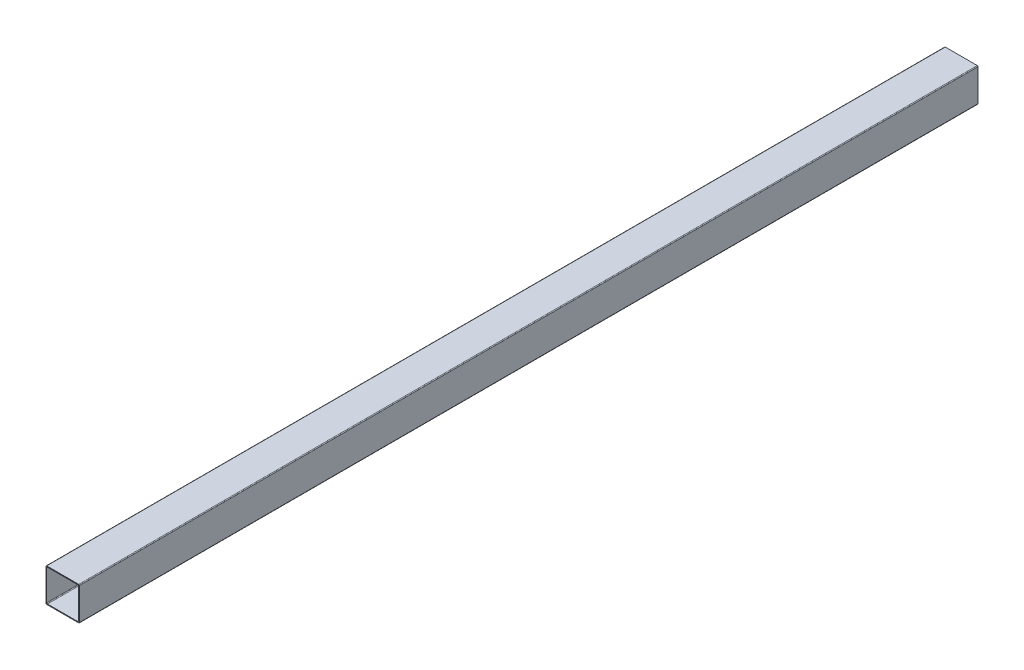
ISO-10303-21;
HEADER;
FILE_DESCRIPTION(('STEP AP214'),'2;1');
FILE_NAME('part.step','',(''),(''),'','','');
FILE_SCHEMA(('AUTOMOTIVE_DESIGN { 1 0 10303 214 1 1 1 1 }'));
ENDSEC;
DATA;
#1=APPLICATION_CONTEXT('core data for automotive mechanical design processes');
#2=APPLICATION_PROTOCOL_DEFINITION('international standard','automotive_design',2000,#1);
#3=PRODUCT_CONTEXT('',#1,'mechanical');
#4=PRODUCT('Part','Part','',(#3));
#5=PRODUCT_RELATED_PRODUCT_CATEGORY('part','',(#4));
#6=PRODUCT_DEFINITION_FORMATION('','',#4);
#7=PRODUCT_DEFINITION_CONTEXT('part definition',#1,'design');
#8=PRODUCT_DEFINITION('design','',#6,#7);
#9=PRODUCT_DEFINITION_SHAPE('','',#8);
#10=(LENGTH_UNIT() NAMED_UNIT(*) SI_UNIT(.MILLI.,.METRE.));
#11=(NAMED_UNIT(*) PLANE_ANGLE_UNIT() SI_UNIT($,.RADIAN.));
#12=(NAMED_UNIT(*) SI_UNIT($,.STERADIAN.) SOLID_ANGLE_UNIT());
#13=UNCERTAINTY_MEASURE_WITH_UNIT(LENGTH_MEASURE(1.E-05),#10,'distance_accuracy_value','');
#14=(GEOMETRIC_REPRESENTATION_CONTEXT(3) GLOBAL_UNCERTAINTY_ASSIGNED_CONTEXT((#13)) GLOBAL_UNIT_ASSIGNED_CONTEXT((#10,
#11,#12)) REPRESENTATION_CONTEXT('',''));
#15=CARTESIAN_POINT('',(0.,0.,0.));
#16=DIRECTION('',(0.,0.,1.));
#17=DIRECTION('',(1.,0.,0.));
#18=AXIS2_PLACEMENT_3D('',#15,#16,#17);
#19=CARTESIAN_POINT('',(-43.,-43.,2420.));
#20=DIRECTION('',(0.,0.,-1.));
#21=DIRECTION('',(-1.,0.,0.));
#22=AXIS2_PLACEMENT_3D('',#19,#20,#21);
#23=PLANE('',#22);
#24=CARTESIAN_POINT('',(-43.,-43.,2420.));
#25=DIRECTION('',(0.,0.,1.));
#26=DIRECTION('',(-1.,0.,0.));
#27=AXIS2_PLACEMENT_3D('',#24,#25,#26);
#28=CIRCLE('',#27,1.99999999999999);
#29=CARTESIAN_POINT('',(-45.,-43.,2420.));
#30=VERTEX_POINT('',#29);
#31=CARTESIAN_POINT('',(-43.,-45.,2420.));
#32=VERTEX_POINT('',#31);
#33=EDGE_CURVE('E211',#30,#32,#28,.T.);
#34=ORIENTED_EDGE('',*,*,#33,.T.);
#35=DIRECTION('',(1.,0.,0.));
#36=VECTOR('',#35,1.);
#37=CARTESIAN_POINT('',(43.,-45.,2420.));
#38=LINE('',#37,#36);
#39=CARTESIAN_POINT('',(43.,-45.,2420.));
#40=VERTEX_POINT('',#39);
#41=EDGE_CURVE('E214',#32,#40,#38,.T.);
#42=ORIENTED_EDGE('',*,*,#41,.T.);
#43=CARTESIAN_POINT('',(43.,-43.,2420.));
#44=DIRECTION('',(0.,0.,1.));
#45=DIRECTION('',(1.,0.,0.));
#46=AXIS2_PLACEMENT_3D('',#43,#44,#45);
#47=CIRCLE('',#46,2.);
#48=CARTESIAN_POINT('',(45.,-43.,2420.));
#49=VERTEX_POINT('',#48);
#50=EDGE_CURVE('E217',#40,#49,#47,.T.);
#51=ORIENTED_EDGE('',*,*,#50,.T.);
#52=DIRECTION('',(0.,1.,0.));
#53=VECTOR('',#52,1.);
#54=CARTESIAN_POINT('',(45.,-43.,2420.));
#55=LINE('',#54,#53);
#56=CARTESIAN_POINT('',(45.,43.,2420.));
#57=VERTEX_POINT('',#56);
#58=EDGE_CURVE('E219',#49,#57,#55,.T.);
#59=ORIENTED_EDGE('',*,*,#58,.T.);
#60=CARTESIAN_POINT('',(43.,43.,2420.));
#61=DIRECTION('',(0.,0.,1.));
#62=DIRECTION('',(1.,0.,0.));
#63=AXIS2_PLACEMENT_3D('',#60,#61,#62);
#64=CIRCLE('',#63,2.00000000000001);
#65=CARTESIAN_POINT('',(43.,45.,2420.));
#66=VERTEX_POINT('',#65);
#67=EDGE_CURVE('E221',#57,#66,#64,.T.);
#68=ORIENTED_EDGE('',*,*,#67,.T.);
#69=DIRECTION('',(-1.,0.,0.));
#70=VECTOR('',#69,1.);
#71=CARTESIAN_POINT('',(43.,45.,2420.));
#72=LINE('',#71,#70);
#73=CARTESIAN_POINT('',(-43.,45.,2420.));
#74=VERTEX_POINT('',#73);
#75=EDGE_CURVE('E223',#66,#74,#72,.T.);
#76=ORIENTED_EDGE('',*,*,#75,.T.);
#77=CARTESIAN_POINT('',(-43.,43.,2420.));
#78=DIRECTION('',(0.,0.,1.));
#79=DIRECTION('',(1.,0.,0.));
#80=AXIS2_PLACEMENT_3D('',#77,#78,#79);
#81=CIRCLE('',#80,2.00000000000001);
#82=CARTESIAN_POINT('',(-45.,43.,2420.));
#83=VERTEX_POINT('',#82);
#84=EDGE_CURVE('E225',#74,#83,#81,.T.);
#85=ORIENTED_EDGE('',*,*,#84,.T.);
#86=DIRECTION('',(0.,-1.,0.));
#87=VECTOR('',#86,1.);
#88=CARTESIAN_POINT('',(-45.,-43.,2420.));
#89=LINE('',#88,#87);
#90=EDGE_CURVE('E227',#83,#30,#89,.T.);
#91=ORIENTED_EDGE('',*,*,#90,.T.);
#92=EDGE_LOOP('',(#34,#42,#51,#59,#68,#76,#85,#91));
#93=FACE_BOUND('',#92,.T.);
#94=CARTESIAN_POINT('',(-41.,41.,2420.));
#95=DIRECTION('',(0.,0.,1.));
#96=DIRECTION('',(1.,0.,0.));
#97=AXIS2_PLACEMENT_3D('',#94,#95,#96);
#98=CIRCLE('',#97,2.00000000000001);
#99=CARTESIAN_POINT('',(-41.,43.,2420.));
#100=VERTEX_POINT('',#99);
#101=CARTESIAN_POINT('',(-43.,41.,2420.));
#102=VERTEX_POINT('',#101);
#103=EDGE_CURVE('E146',#100,#102,#98,.T.);
#104=ORIENTED_EDGE('',*,*,#103,.F.);
#105=DIRECTION('',(-1.,0.,0.));
#106=VECTOR('',#105,1.);
#107=CARTESIAN_POINT('',(41.,43.,2420.));
#108=LINE('',#107,#106);
#109=CARTESIAN_POINT('',(41.,43.,2420.));
#110=VERTEX_POINT('',#109);
#111=EDGE_CURVE('E179',#110,#100,#108,.T.);
#112=ORIENTED_EDGE('',*,*,#111,.F.);
#113=CARTESIAN_POINT('',(41.,41.,2420.));
#114=DIRECTION('',(0.,0.,1.));
#115=DIRECTION('',(1.,0.,0.));
#116=AXIS2_PLACEMENT_3D('',#113,#114,#115);
#117=CIRCLE('',#116,2.00000000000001);
#118=CARTESIAN_POINT('',(43.,41.,2420.));
#119=VERTEX_POINT('',#118);
#120=EDGE_CURVE('E177',#119,#110,#117,.T.);
#121=ORIENTED_EDGE('',*,*,#120,.F.);
#122=DIRECTION('',(0.,1.,0.));
#123=VECTOR('',#122,1.);
#124=CARTESIAN_POINT('',(43.,-41.,2420.));
#125=LINE('',#124,#123);
#126=CARTESIAN_POINT('',(43.,-41.,2420.));
#127=VERTEX_POINT('',#126);
#128=EDGE_CURVE('E175',#127,#119,#125,.T.);
#129=ORIENTED_EDGE('',*,*,#128,.F.);
#130=CARTESIAN_POINT('',(41.,-41.,2420.));
#131=DIRECTION('',(0.,0.,1.));
#132=DIRECTION('',(1.,0.,0.));
#133=AXIS2_PLACEMENT_3D('',#130,#131,#132);
#134=CIRCLE('',#133,2.);
#135=CARTESIAN_POINT('',(41.,-43.,2420.));
#136=VERTEX_POINT('',#135);
#137=EDGE_CURVE('E173',#136,#127,#134,.T.);
#138=ORIENTED_EDGE('',*,*,#137,.F.);
#139=DIRECTION('',(1.,0.,0.));
#140=VECTOR('',#139,1.);
#141=CARTESIAN_POINT('',(41.,-43.,2420.));
#142=LINE('',#141,#140);
#143=CARTESIAN_POINT('',(-41.,-43.,2420.));
#144=VERTEX_POINT('',#143);
#145=EDGE_CURVE('E169',#144,#136,#142,.T.);
#146=ORIENTED_EDGE('',*,*,#145,.F.);
#147=CARTESIAN_POINT('',(-41.,-41.,2420.));
#148=DIRECTION('',(0.,0.,1.));
#149=DIRECTION('',(-1.,0.,0.));
#150=AXIS2_PLACEMENT_3D('',#147,#148,#149);
#151=CIRCLE('',#150,1.99999999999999);
#152=CARTESIAN_POINT('',(-43.,-41.,2420.));
#153=VERTEX_POINT('',#152);
#154=EDGE_CURVE('E167',#153,#144,#151,.T.);
#155=ORIENTED_EDGE('',*,*,#154,.F.);
#156=DIRECTION('',(0.,-1.,0.));
#157=VECTOR('',#156,1.);
#158=CARTESIAN_POINT('',(-43.,-41.,2420.));
#159=LINE('',#158,#157);
#160=EDGE_CURVE('E154',#102,#153,#159,.T.);
#161=ORIENTED_EDGE('',*,*,#160,.F.);
#162=EDGE_LOOP('',(#104,#112,#121,#129,#138,#146,#155,#161));
#163=FACE_BOUND('',#162,.T.);
#164=ADVANCED_FACE('F33',(#93,#163),#23,.F.);
#165=CARTESIAN_POINT('',(-43.,-43.,0.));
#166=DIRECTION('',(0.,0.,-1.));
#167=DIRECTION('',(-1.,0.,0.));
#168=AXIS2_PLACEMENT_3D('',#165,#166,#167);
#169=PLANE('',#168);
#170=CARTESIAN_POINT('',(-43.,-43.,0.));
#171=DIRECTION('',(0.,0.,1.));
#172=DIRECTION('',(-1.,0.,0.));
#173=AXIS2_PLACEMENT_3D('',#170,#171,#172);
#174=CIRCLE('',#173,1.99999999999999);
#175=CARTESIAN_POINT('',(-45.,-43.,0.));
#176=VERTEX_POINT('',#175);
#177=CARTESIAN_POINT('',(-43.,-45.,0.));
#178=VERTEX_POINT('',#177);
#179=EDGE_CURVE('E162',#176,#178,#174,.T.);
#180=ORIENTED_EDGE('',*,*,#179,.F.);
#181=DIRECTION('',(0.,-1.,0.));
#182=VECTOR('',#181,1.);
#183=CARTESIAN_POINT('',(-45.,-43.,0.));
#184=LINE('',#183,#182);
#185=CARTESIAN_POINT('',(-45.,43.,0.));
#186=VERTEX_POINT('',#185);
#187=EDGE_CURVE('E215',#186,#176,#184,.T.);
#188=ORIENTED_EDGE('',*,*,#187,.F.);
#189=CARTESIAN_POINT('',(-43.,43.,0.));
#190=DIRECTION('',(0.,0.,1.));
#191=DIRECTION('',(1.,0.,0.));
#192=AXIS2_PLACEMENT_3D('',#189,#190,#191);
#193=CIRCLE('',#192,2.00000000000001);
#194=CARTESIAN_POINT('',(-43.,45.,0.));
#195=VERTEX_POINT('',#194);
#196=EDGE_CURVE('E242',#195,#186,#193,.T.);
#197=ORIENTED_EDGE('',*,*,#196,.F.);
#198=DIRECTION('',(-1.,0.,0.));
#199=VECTOR('',#198,1.);
#200=CARTESIAN_POINT('',(43.,45.,0.));
#201=LINE('',#200,#199);
#202=CARTESIAN_POINT('',(43.,45.,0.));
#203=VERTEX_POINT('',#202);
#204=EDGE_CURVE('E240',#203,#195,#201,.T.);
#205=ORIENTED_EDGE('',*,*,#204,.F.);
#206=CARTESIAN_POINT('',(43.,43.,0.));
#207=DIRECTION('',(0.,0.,1.));
#208=DIRECTION('',(1.,0.,0.));
#209=AXIS2_PLACEMENT_3D('',#206,#207,#208);
#210=CIRCLE('',#209,2.00000000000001);
#211=CARTESIAN_POINT('',(45.,43.,0.));
#212=VERTEX_POINT('',#211);
#213=EDGE_CURVE('E238',#212,#203,#210,.T.);
#214=ORIENTED_EDGE('',*,*,#213,.F.);
#215=DIRECTION('',(0.,1.,0.));
#216=VECTOR('',#215,1.);
#217=CARTESIAN_POINT('',(45.,-43.,0.));
#218=LINE('',#217,#216);
#219=CARTESIAN_POINT('',(45.,-43.,0.));
#220=VERTEX_POINT('',#219);
#221=EDGE_CURVE('E236',#220,#212,#218,.T.);
#222=ORIENTED_EDGE('',*,*,#221,.F.);
#223=CARTESIAN_POINT('',(43.,-43.,0.));
#224=DIRECTION('',(0.,0.,1.));
#225=DIRECTION('',(1.,0.,0.));
#226=AXIS2_PLACEMENT_3D('',#223,#224,#225);
#227=CIRCLE('',#226,2.);
#228=CARTESIAN_POINT('',(43.,-45.,0.));
#229=VERTEX_POINT('',#228);
#230=EDGE_CURVE('E234',#229,#220,#227,.T.);
#231=ORIENTED_EDGE('',*,*,#230,.F.);
#232=DIRECTION('',(1.,0.,0.));
#233=VECTOR('',#232,1.);
#234=CARTESIAN_POINT('',(43.,-45.,0.));
#235=LINE('',#234,#233);
#236=EDGE_CURVE('E232',#178,#229,#235,.T.);
#237=ORIENTED_EDGE('',*,*,#236,.F.);
#238=EDGE_LOOP('',(#180,#188,#197,#205,#214,#222,#231,#237));
#239=FACE_BOUND('',#238,.T.);
#240=DIRECTION('',(-1.,0.,0.));
#241=VECTOR('',#240,1.);
#242=CARTESIAN_POINT('',(41.,43.,0.));
#243=LINE('',#242,#241);
#244=CARTESIAN_POINT('',(41.,43.,0.));
#245=VERTEX_POINT('',#244);
#246=CARTESIAN_POINT('',(-41.,43.,0.));
#247=VERTEX_POINT('',#246);
#248=EDGE_CURVE('E155',#245,#247,#243,.T.);
#249=ORIENTED_EDGE('',*,*,#248,.T.);
#250=CARTESIAN_POINT('',(-41.,41.,0.));
#251=DIRECTION('',(0.,0.,1.));
#252=DIRECTION('',(1.,0.,0.));
#253=AXIS2_PLACEMENT_3D('',#250,#251,#252);
#254=CIRCLE('',#253,2.00000000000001);
#255=CARTESIAN_POINT('',(-43.,41.,0.));
#256=VERTEX_POINT('',#255);
#257=EDGE_CURVE('E56',#247,#256,#254,.T.);
#258=ORIENTED_EDGE('',*,*,#257,.T.);
#259=DIRECTION('',(0.,-1.,0.));
#260=VECTOR('',#259,1.);
#261=CARTESIAN_POINT('',(-43.,-41.,0.));
#262=LINE('',#261,#260);
#263=CARTESIAN_POINT('',(-43.,-41.,0.));
#264=VERTEX_POINT('',#263);
#265=EDGE_CURVE('E161',#256,#264,#262,.T.);
#266=ORIENTED_EDGE('',*,*,#265,.T.);
#267=CARTESIAN_POINT('',(-41.,-41.,0.));
#268=DIRECTION('',(0.,0.,1.));
#269=DIRECTION('',(-1.,0.,0.));
#270=AXIS2_PLACEMENT_3D('',#267,#268,#269);
#271=CIRCLE('',#270,1.99999999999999);
#272=CARTESIAN_POINT('',(-41.,-43.,0.));
#273=VERTEX_POINT('',#272);
#274=EDGE_CURVE('E183',#264,#273,#271,.T.);
#275=ORIENTED_EDGE('',*,*,#274,.T.);
#276=DIRECTION('',(1.,0.,0.));
#277=VECTOR('',#276,1.);
#278=CARTESIAN_POINT('',(41.,-43.,0.));
#279=LINE('',#278,#277);
#280=CARTESIAN_POINT('',(41.,-43.,0.));
#281=VERTEX_POINT('',#280);
#282=EDGE_CURVE('E186',#273,#281,#279,.T.);
#283=ORIENTED_EDGE('',*,*,#282,.T.);
#284=CARTESIAN_POINT('',(41.,-41.,0.));
#285=DIRECTION('',(0.,0.,1.));
#286=DIRECTION('',(1.,0.,0.));
#287=AXIS2_PLACEMENT_3D('',#284,#285,#286);
#288=CIRCLE('',#287,2.);
#289=CARTESIAN_POINT('',(43.,-41.,0.));
#290=VERTEX_POINT('',#289);
#291=EDGE_CURVE('E189',#281,#290,#288,.T.);
#292=ORIENTED_EDGE('',*,*,#291,.T.);
#293=DIRECTION('',(0.,1.,0.));
#294=VECTOR('',#293,1.);
#295=CARTESIAN_POINT('',(43.,-41.,0.));
#296=LINE('',#295,#294);
#297=CARTESIAN_POINT('',(43.,41.,0.));
#298=VERTEX_POINT('',#297);
#299=EDGE_CURVE('E192',#290,#298,#296,.T.);
#300=ORIENTED_EDGE('',*,*,#299,.T.);
#301=CARTESIAN_POINT('',(41.,41.,0.));
#302=DIRECTION('',(0.,0.,1.));
#303=DIRECTION('',(1.,0.,0.));
#304=AXIS2_PLACEMENT_3D('',#301,#302,#303);
#305=CIRCLE('',#304,2.00000000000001);
#306=EDGE_CURVE('E195',#298,#245,#305,.T.);
#307=ORIENTED_EDGE('',*,*,#306,.T.);
#308=EDGE_LOOP('',(#249,#258,#266,#275,#283,#292,#300,#307));
#309=FACE_BOUND('',#308,.T.);
#310=ADVANCED_FACE('F272',(#239,#309),#169,.T.);
#311=CARTESIAN_POINT('',(-43.,-43.,2420.));
#312=DIRECTION('',(0.,0.,-1.));
#313=DIRECTION('',(-1.,0.,0.));
#314=AXIS2_PLACEMENT_3D('',#311,#312,#313);
#315=CYLINDRICAL_SURFACE('',#314,1.99999999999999);
#316=ORIENTED_EDGE('',*,*,#179,.T.);
#317=DIRECTION('',(0.,0.,-1.));
#318=VECTOR('',#317,1.);
#319=CARTESIAN_POINT('',(-43.,-45.,2420.));
#320=LINE('',#319,#318);
#321=EDGE_CURVE('E11',#32,#178,#320,.T.);
#322=ORIENTED_EDGE('',*,*,#321,.F.);
#323=ORIENTED_EDGE('',*,*,#33,.F.);
#324=DIRECTION('',(0.,0.,-1.));
#325=VECTOR('',#324,1.);
#326=CARTESIAN_POINT('',(-45.,-43.,2420.));
#327=LINE('',#326,#325);
#328=EDGE_CURVE('E229',#30,#176,#327,.T.);
#329=ORIENTED_EDGE('',*,*,#328,.T.);
#330=EDGE_LOOP('',(#316,#322,#323,#329));
#331=FACE_BOUND('',#330,.T.);
#332=ADVANCED_FACE('F35',(#331),#315,.T.);
#333=CARTESIAN_POINT('',(43.,-45.,2420.));
#334=DIRECTION('',(0.,1.,0.));
#335=DIRECTION('',(-1.,0.,0.));
#336=AXIS2_PLACEMENT_3D('',#333,#334,#335);
#337=PLANE('',#336);
#338=ORIENTED_EDGE('',*,*,#236,.T.);
#339=DIRECTION('',(0.,0.,-1.));
#340=VECTOR('',#339,1.);
#341=CARTESIAN_POINT('',(43.,-45.,2420.));
#342=LINE('',#341,#340);
#343=EDGE_CURVE('E41',#40,#229,#342,.T.);
#344=ORIENTED_EDGE('',*,*,#343,.F.);
#345=ORIENTED_EDGE('',*,*,#41,.F.);
#346=ORIENTED_EDGE('',*,*,#321,.T.);
#347=EDGE_LOOP('',(#338,#344,#345,#346));
#348=FACE_BOUND('',#347,.T.);
#349=ADVANCED_FACE('F289',(#348),#337,.F.);
#350=CARTESIAN_POINT('',(43.,-43.,2420.));
#351=DIRECTION('',(0.,0.,-1.));
#352=DIRECTION('',(-1.,0.,0.));
#353=AXIS2_PLACEMENT_3D('',#350,#351,#352);
#354=CYLINDRICAL_SURFACE('',#353,2.);
#355=ORIENTED_EDGE('',*,*,#230,.T.);
#356=DIRECTION('',(0.,0.,-1.));
#357=VECTOR('',#356,1.);
#358=CARTESIAN_POINT('',(45.,-43.,2420.));
#359=LINE('',#358,#357);
#360=EDGE_CURVE('E259',#49,#220,#359,.T.);
#361=ORIENTED_EDGE('',*,*,#360,.F.);
#362=ORIENTED_EDGE('',*,*,#50,.F.);
#363=ORIENTED_EDGE('',*,*,#343,.T.);
#364=EDGE_LOOP('',(#355,#361,#362,#363));
#365=FACE_BOUND('',#364,.T.);
#366=ADVANCED_FACE('F266',(#365),#354,.T.);
#367=CARTESIAN_POINT('',(45.,-43.,2420.));
#368=DIRECTION('',(-1.,0.,0.));
#369=DIRECTION('',(0.,-1.,0.));
#370=AXIS2_PLACEMENT_3D('',#367,#368,#369);
#371=PLANE('',#370);
#372=ORIENTED_EDGE('',*,*,#221,.T.);
#373=DIRECTION('',(0.,0.,-1.));
#374=VECTOR('',#373,1.);
#375=CARTESIAN_POINT('',(45.,43.,2420.));
#376=LINE('',#375,#374);
#377=EDGE_CURVE('E256',#57,#212,#376,.T.);
#378=ORIENTED_EDGE('',*,*,#377,.F.);
#379=ORIENTED_EDGE('',*,*,#58,.F.);
#380=ORIENTED_EDGE('',*,*,#360,.T.);
#381=EDGE_LOOP('',(#372,#378,#379,#380));
#382=FACE_BOUND('',#381,.T.);
#383=ADVANCED_FACE('F278',(#382),#371,.F.);
#384=CARTESIAN_POINT('',(43.,43.,2420.));
#385=DIRECTION('',(0.,0.,-1.));
#386=DIRECTION('',(-1.,0.,0.));
#387=AXIS2_PLACEMENT_3D('',#384,#385,#386);
#388=CYLINDRICAL_SURFACE('',#387,2.00000000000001);
#389=ORIENTED_EDGE('',*,*,#213,.T.);
#390=DIRECTION('',(0.,0.,-1.));
#391=VECTOR('',#390,1.);
#392=CARTESIAN_POINT('',(43.,45.,2420.));
#393=LINE('',#392,#391);
#394=EDGE_CURVE('E253',#66,#203,#393,.T.);
#395=ORIENTED_EDGE('',*,*,#394,.F.);
#396=ORIENTED_EDGE('',*,*,#67,.F.);
#397=ORIENTED_EDGE('',*,*,#377,.T.);
#398=EDGE_LOOP('',(#389,#395,#396,#397));
#399=FACE_BOUND('',#398,.T.);
#400=ADVANCED_FACE('F282',(#399),#388,.T.);
#401=CARTESIAN_POINT('',(43.,45.,2420.));
#402=DIRECTION('',(0.,-1.,0.));
#403=DIRECTION('',(1.,0.,0.));
#404=AXIS2_PLACEMENT_3D('',#401,#402,#403);
#405=PLANE('',#404);
#406=ORIENTED_EDGE('',*,*,#204,.T.);
#407=DIRECTION('',(0.,0.,-1.));
#408=VECTOR('',#407,1.);
#409=CARTESIAN_POINT('',(-43.,45.,2420.));
#410=LINE('',#409,#408);
#411=EDGE_CURVE('E250',#74,#195,#410,.T.);
#412=ORIENTED_EDGE('',*,*,#411,.F.);
#413=ORIENTED_EDGE('',*,*,#75,.F.);
#414=ORIENTED_EDGE('',*,*,#394,.T.);
#415=EDGE_LOOP('',(#406,#412,#413,#414));
#416=FACE_BOUND('',#415,.T.);
#417=ADVANCED_FACE('F302',(#416),#405,.F.);
#418=CARTESIAN_POINT('',(-43.,43.,2420.));
#419=DIRECTION('',(0.,0.,-1.));
#420=DIRECTION('',(-1.,0.,0.));
#421=AXIS2_PLACEMENT_3D('',#418,#419,#420);
#422=CYLINDRICAL_SURFACE('',#421,2.00000000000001);
#423=ORIENTED_EDGE('',*,*,#196,.T.);
#424=DIRECTION('',(0.,0.,-1.));
#425=VECTOR('',#424,1.);
#426=CARTESIAN_POINT('',(-45.,43.,2420.));
#427=LINE('',#426,#425);
#428=EDGE_CURVE('E247',#83,#186,#427,.T.);
#429=ORIENTED_EDGE('',*,*,#428,.F.);
#430=ORIENTED_EDGE('',*,*,#84,.F.);
#431=ORIENTED_EDGE('',*,*,#411,.T.);
#432=EDGE_LOOP('',(#423,#429,#430,#431));
#433=FACE_BOUND('',#432,.T.);
#434=ADVANCED_FACE('F300',(#433),#422,.T.);
#435=CARTESIAN_POINT('',(-45.,-43.,2420.));
#436=DIRECTION('',(1.,0.,0.));
#437=DIRECTION('',(0.,1.,0.));
#438=AXIS2_PLACEMENT_3D('',#435,#436,#437);
#439=PLANE('',#438);
#440=ORIENTED_EDGE('',*,*,#187,.T.);
#441=ORIENTED_EDGE('',*,*,#328,.F.);
#442=ORIENTED_EDGE('',*,*,#90,.F.);
#443=ORIENTED_EDGE('',*,*,#428,.T.);
#444=EDGE_LOOP('',(#440,#441,#442,#443));
#445=FACE_BOUND('',#444,.T.);
#446=ADVANCED_FACE('F295',(#445),#439,.F.);
#447=CARTESIAN_POINT('',(-41.,41.,2420.));
#448=DIRECTION('',(0.,0.,-1.));
#449=DIRECTION('',(-1.,0.,0.));
#450=AXIS2_PLACEMENT_3D('',#447,#448,#449);
#451=CYLINDRICAL_SURFACE('',#450,2.00000000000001);
#452=ORIENTED_EDGE('',*,*,#257,.F.);
#453=DIRECTION('',(0.,0.,-1.));
#454=VECTOR('',#453,1.);
#455=CARTESIAN_POINT('',(-41.,43.,2420.));
#456=LINE('',#455,#454);
#457=EDGE_CURVE('E150',#100,#247,#456,.T.);
#458=ORIENTED_EDGE('',*,*,#457,.F.);
#459=ORIENTED_EDGE('',*,*,#103,.T.);
#460=DIRECTION('',(0.,0.,-1.));
#461=VECTOR('',#460,1.);
#462=CARTESIAN_POINT('',(-43.,41.,2420.));
#463=LINE('',#462,#461);
#464=EDGE_CURVE('E149',#102,#256,#463,.T.);
#465=ORIENTED_EDGE('',*,*,#464,.T.);
#466=EDGE_LOOP('',(#452,#458,#459,#465));
#467=FACE_BOUND('',#466,.T.);
#468=ADVANCED_FACE('F148',(#467),#451,.F.);
#469=CARTESIAN_POINT('',(-43.,-41.,2420.));
#470=DIRECTION('',(1.,0.,0.));
#471=DIRECTION('',(0.,1.,0.));
#472=AXIS2_PLACEMENT_3D('',#469,#470,#471);
#473=PLANE('',#472);
#474=ORIENTED_EDGE('',*,*,#265,.F.);
#475=ORIENTED_EDGE('',*,*,#464,.F.);
#476=ORIENTED_EDGE('',*,*,#160,.T.);
#477=DIRECTION('',(0.,0.,-1.));
#478=VECTOR('',#477,1.);
#479=CARTESIAN_POINT('',(-43.,-41.,2420.));
#480=LINE('',#479,#478);
#481=EDGE_CURVE('E163',#153,#264,#480,.T.);
#482=ORIENTED_EDGE('',*,*,#481,.T.);
#483=EDGE_LOOP('',(#474,#475,#476,#482));
#484=FACE_BOUND('',#483,.T.);
#485=ADVANCED_FACE('F158',(#484),#473,.T.);
#486=CARTESIAN_POINT('',(-41.,-41.,2420.));
#487=DIRECTION('',(0.,0.,-1.));
#488=DIRECTION('',(-1.,0.,0.));
#489=AXIS2_PLACEMENT_3D('',#486,#487,#488);
#490=CYLINDRICAL_SURFACE('',#489,1.99999999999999);
#491=ORIENTED_EDGE('',*,*,#274,.F.);
#492=ORIENTED_EDGE('',*,*,#481,.F.);
#493=ORIENTED_EDGE('',*,*,#154,.T.);
#494=DIRECTION('',(0.,0.,-1.));
#495=VECTOR('',#494,1.);
#496=CARTESIAN_POINT('',(-41.,-43.,2420.));
#497=LINE('',#496,#495);
#498=EDGE_CURVE('E208',#144,#273,#497,.T.);
#499=ORIENTED_EDGE('',*,*,#498,.T.);
#500=EDGE_LOOP('',(#491,#492,#493,#499));
#501=FACE_BOUND('',#500,.T.);
#502=ADVANCED_FACE('F327',(#501),#490,.F.);
#503=CARTESIAN_POINT('',(41.,-43.,2420.));
#504=DIRECTION('',(0.,1.,0.));
#505=DIRECTION('',(0.,0.,1.));
#506=AXIS2_PLACEMENT_3D('',#503,#504,#505);
#507=PLANE('',#506);
#508=ORIENTED_EDGE('',*,*,#282,.F.);
#509=ORIENTED_EDGE('',*,*,#498,.F.);
#510=ORIENTED_EDGE('',*,*,#145,.T.);
#511=DIRECTION('',(0.,0.,-1.));
#512=VECTOR('',#511,1.);
#513=CARTESIAN_POINT('',(41.,-43.,2420.));
#514=LINE('',#513,#512);
#515=EDGE_CURVE('E206',#136,#281,#514,.T.);
#516=ORIENTED_EDGE('',*,*,#515,.T.);
#517=EDGE_LOOP('',(#508,#509,#510,#516));
#518=FACE_BOUND('',#517,.T.);
#519=ADVANCED_FACE('F331',(#518),#507,.T.);
#520=CARTESIAN_POINT('',(41.,-41.,2420.));
#521=DIRECTION('',(0.,0.,-1.));
#522=DIRECTION('',(-1.,0.,0.));
#523=AXIS2_PLACEMENT_3D('',#520,#521,#522);
#524=CYLINDRICAL_SURFACE('',#523,2.);
#525=ORIENTED_EDGE('',*,*,#291,.F.);
#526=ORIENTED_EDGE('',*,*,#515,.F.);
#527=ORIENTED_EDGE('',*,*,#137,.T.);
#528=DIRECTION('',(0.,0.,-1.));
#529=VECTOR('',#528,1.);
#530=CARTESIAN_POINT('',(43.,-41.,2420.));
#531=LINE('',#530,#529);
#532=EDGE_CURVE('E204',#127,#290,#531,.T.);
#533=ORIENTED_EDGE('',*,*,#532,.T.);
#534=EDGE_LOOP('',(#525,#526,#527,#533));
#535=FACE_BOUND('',#534,.T.);
#536=ADVANCED_FACE('F337',(#535),#524,.F.);
#537=CARTESIAN_POINT('',(43.,-41.,2420.));
#538=DIRECTION('',(-1.,0.,0.));
#539=DIRECTION('',(0.,-1.,0.));
#540=AXIS2_PLACEMENT_3D('',#537,#538,#539);
#541=PLANE('',#540);
#542=ORIENTED_EDGE('',*,*,#299,.F.);
#543=ORIENTED_EDGE('',*,*,#532,.F.);
#544=ORIENTED_EDGE('',*,*,#128,.T.);
#545=DIRECTION('',(0.,0.,-1.));
#546=VECTOR('',#545,1.);
#547=CARTESIAN_POINT('',(43.,41.,2420.));
#548=LINE('',#547,#546);
#549=EDGE_CURVE('E202',#119,#298,#548,.T.);
#550=ORIENTED_EDGE('',*,*,#549,.T.);
#551=EDGE_LOOP('',(#542,#543,#544,#550));
#552=FACE_BOUND('',#551,.T.);
#553=ADVANCED_FACE('F341',(#552),#541,.T.);
#554=CARTESIAN_POINT('',(41.,41.,2420.));
#555=DIRECTION('',(0.,0.,-1.));
#556=DIRECTION('',(-1.,0.,0.));
#557=AXIS2_PLACEMENT_3D('',#554,#555,#556);
#558=CYLINDRICAL_SURFACE('',#557,2.00000000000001);
#559=ORIENTED_EDGE('',*,*,#306,.F.);
#560=ORIENTED_EDGE('',*,*,#549,.F.);
#561=ORIENTED_EDGE('',*,*,#120,.T.);
#562=DIRECTION('',(0.,0.,-1.));
#563=VECTOR('',#562,1.);
#564=CARTESIAN_POINT('',(41.,43.,2420.));
#565=LINE('',#564,#563);
#566=EDGE_CURVE('E48',#110,#245,#565,.T.);
#567=ORIENTED_EDGE('',*,*,#566,.T.);
#568=EDGE_LOOP('',(#559,#560,#561,#567));
#569=FACE_BOUND('',#568,.T.);
#570=ADVANCED_FACE('F345',(#569),#558,.F.);
#571=CARTESIAN_POINT('',(41.,43.,2420.));
#572=DIRECTION('',(0.,-1.,0.));
#573=DIRECTION('',(0.,0.,-1.));
#574=AXIS2_PLACEMENT_3D('',#571,#572,#573);
#575=PLANE('',#574);
#576=ORIENTED_EDGE('',*,*,#248,.F.);
#577=ORIENTED_EDGE('',*,*,#566,.F.);
#578=ORIENTED_EDGE('',*,*,#111,.T.);
#579=ORIENTED_EDGE('',*,*,#457,.T.);
#580=EDGE_LOOP('',(#576,#577,#578,#579));
#581=FACE_BOUND('',#580,.T.);
#582=ADVANCED_FACE('F349',(#581),#575,.T.);
#583=CLOSED_SHELL('',(#164,#310,#332,#349,#366,#383,#400,#417,#434,#446,#468,#485,#502,#519,
#536,#553,#570,#582));
#584=MANIFOLD_SOLID_BREP('B2',#583);
#585=ADVANCED_BREP_SHAPE_REPRESENTATION('',(#18,#584),#14);
#586=SHAPE_DEFINITION_REPRESENTATION(#9,#585);
ENDSEC;
END-ISO-10303-21;
